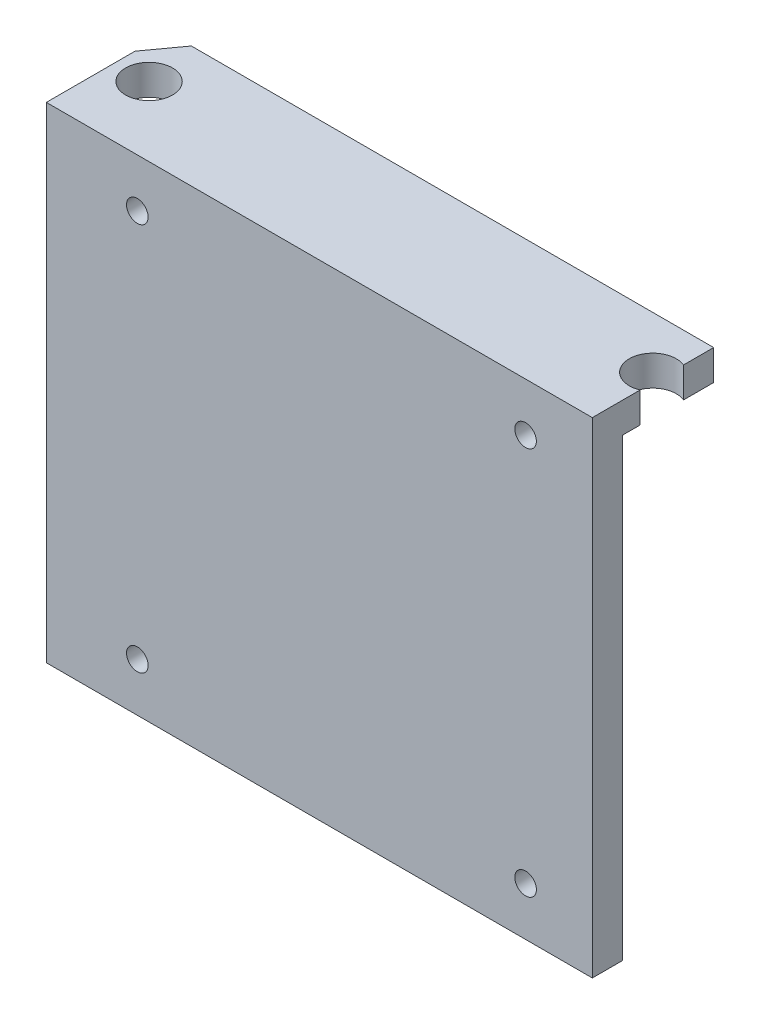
from build123d import *

# Parameters (mm, degrees)
BOSS_EXTRUDE1_DEPTH          = 33.655
F_4_40_TAPPED_HOLE1_D        = 2.2606
F_10_0_1935_DIAMETER_HOLE1_D = 4.9149
CUT_EXTRUDE1_DEPTH           = 64.607858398
SKETCH7_W                    = 6.35
SKETCH7_H                    = 50.8
SKETCH7_W_2                  = 3.81
CUT_EXTRUDE2_DEPTH           = 63.246196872


with BuildPart() as part:
    # Sketch1 → Boss-Extrude1 (new, symmetric)
    with BuildSketch(Plane(origin=(0, 0, 0), x_dir=(0, 0, -1), z_dir=(1, 0, 0))):
        Polygon((0, 0), (0, -50.8), (3.175, -50.8), (3.175, -3.175), (25.4, -3.175), (25.4, 0), align=None)
    extrude(amount=BOSS_EXTRUDE1_DEPTH, both=True)

    # 4-40 Tapped Hole1 (through all)
    with Locations(Plane.XY):
        with Locations((-20.32, -45.72), (-20.32, -5.08), (20.32, -5.08), (20.32, -45.72)):
            Hole(F_4_40_TAPPED_HOLE1_D / 2)

    # 10 _0.1935_ Diameter Hole1 (through all)
    with Locations(Plane(origin=(0, 0, 0), x_dir=(1, 0, 0), z_dir=(0, 1, 0))):
        with Locations((-26.362180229, 7.270909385), (26.362180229, 7.270909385)):
            Hole(F_10_0_1935_DIAMETER_HOLE1_D / 2)

    # Sketch6 → Cut-Extrude1 (cut, through all)
    with BuildSketch(Plane.XZ.offset(3.175)):
        Polygon((33.655, -4.039261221), (27.362604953, -12.7), (-27.362604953, -12.7), (-33.655, -4.039261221), (-33.655, -25.4), (33.655, -25.4), align=None)
    extrude(amount=-CUT_EXTRUDE1_DEPTH, mode=Mode.SUBTRACT)

    # Sketch7 → Cut-Extrude2 (cut, through all)
    with BuildSketch(Plane.XY):
        with Locations((30.48, -25.4)):
            Rectangle(SKETCH7_W, SKETCH7_H)
        with Locations((-31.75, -25.4)):
            Rectangle(SKETCH7_W_2, SKETCH7_H)
    extrude(amount=-CUT_EXTRUDE2_DEPTH, mode=Mode.SUBTRACT)


solid = part.part
